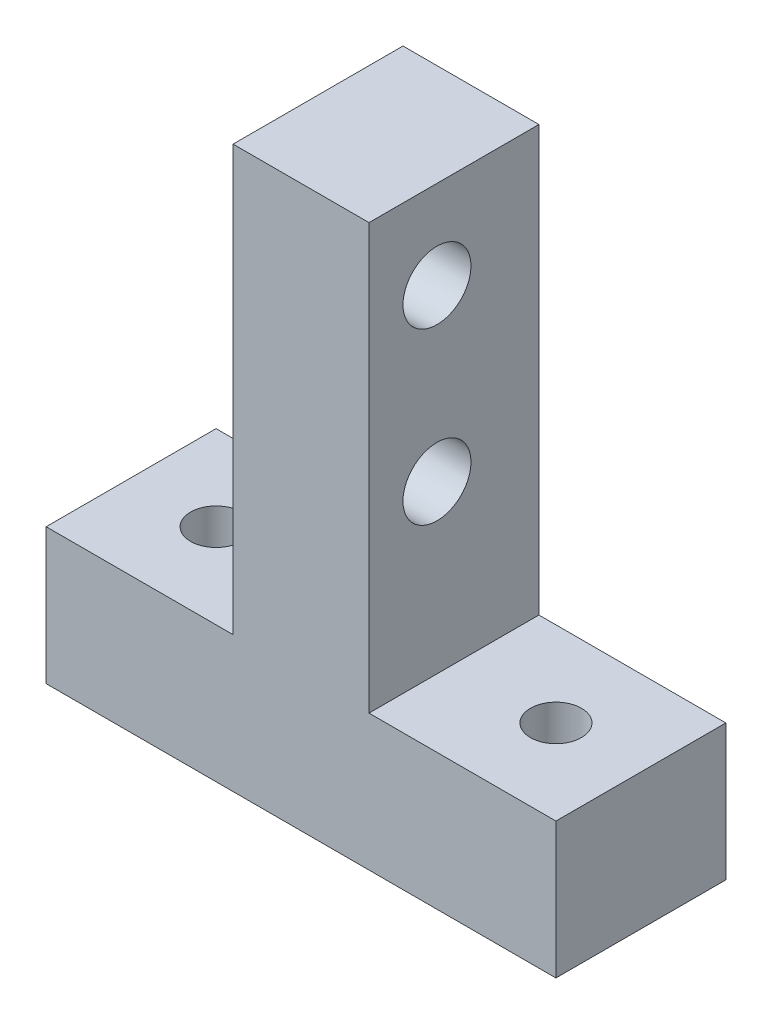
ISO-10303-21;
HEADER;
FILE_DESCRIPTION(('STEP AP214'),'2;1');
FILE_NAME('part.step','',(''),(''),'','','');
FILE_SCHEMA(('AUTOMOTIVE_DESIGN { 1 0 10303 214 1 1 1 1 }'));
ENDSEC;
DATA;
#1=APPLICATION_CONTEXT('core data for automotive mechanical design processes');
#2=APPLICATION_PROTOCOL_DEFINITION('international standard','automotive_design',2000,#1);
#3=PRODUCT_CONTEXT('',#1,'mechanical');
#4=PRODUCT('Part','Part','',(#3));
#5=PRODUCT_RELATED_PRODUCT_CATEGORY('part','',(#4));
#6=PRODUCT_DEFINITION_FORMATION('','',#4);
#7=PRODUCT_DEFINITION_CONTEXT('part definition',#1,'design');
#8=PRODUCT_DEFINITION('design','',#6,#7);
#9=PRODUCT_DEFINITION_SHAPE('','',#8);
#10=(LENGTH_UNIT() NAMED_UNIT(*) SI_UNIT(.MILLI.,.METRE.));
#11=(NAMED_UNIT(*) PLANE_ANGLE_UNIT() SI_UNIT($,.RADIAN.));
#12=(NAMED_UNIT(*) SI_UNIT($,.STERADIAN.) SOLID_ANGLE_UNIT());
#13=UNCERTAINTY_MEASURE_WITH_UNIT(LENGTH_MEASURE(1.E-05),#10,'distance_accuracy_value','');
#14=(GEOMETRIC_REPRESENTATION_CONTEXT(3) GLOBAL_UNCERTAINTY_ASSIGNED_CONTEXT((#13)) GLOBAL_UNIT_ASSIGNED_CONTEXT((#10,
#11,#12)) REPRESENTATION_CONTEXT('',''));
#15=CARTESIAN_POINT('',(0.,0.,0.));
#16=DIRECTION('',(0.,0.,1.));
#17=DIRECTION('',(1.,0.,0.));
#18=AXIS2_PLACEMENT_3D('',#15,#16,#17);
#19=CARTESIAN_POINT('',(0.,8.,0.));
#20=DIRECTION('',(0.,1.,0.));
#21=DIRECTION('',(0.,0.,1.));
#22=AXIS2_PLACEMENT_3D('',#19,#20,#21);
#23=PLANE('',#22);
#24=CARTESIAN_POINT('',(10.,8.,0.));
#25=DIRECTION('',(0.,1.,0.));
#26=DIRECTION('',(0.,0.,1.));
#27=AXIS2_PLACEMENT_3D('',#24,#25,#26);
#28=CIRCLE('',#27,1.5);
#29=CARTESIAN_POINT('',(10.,8.,1.5));
#30=VERTEX_POINT('',#29);
#31=EDGE_CURVE('E178',#30,#30,#28,.T.);
#32=ORIENTED_EDGE('',*,*,#31,.F.);
#33=EDGE_LOOP('',(#32));
#34=FACE_BOUND('',#33,.T.);
#35=DIRECTION('',(0.,0.,-1.));
#36=VECTOR('',#35,1.);
#37=CARTESIAN_POINT('',(4.,8.,-5.));
#38=LINE('',#37,#36);
#39=CARTESIAN_POINT('',(4.,8.,5.));
#40=VERTEX_POINT('',#39);
#41=CARTESIAN_POINT('',(4.,8.,-5.));
#42=VERTEX_POINT('',#41);
#43=EDGE_CURVE('E47',#40,#42,#38,.T.);
#44=ORIENTED_EDGE('',*,*,#43,.F.);
#45=DIRECTION('',(1.,0.,0.));
#46=VECTOR('',#45,1.);
#47=CARTESIAN_POINT('',(-15.,8.,5.));
#48=LINE('',#47,#46);
#49=CARTESIAN_POINT('',(15.,8.,5.));
#50=VERTEX_POINT('',#49);
#51=EDGE_CURVE('E136',#40,#50,#48,.T.);
#52=ORIENTED_EDGE('',*,*,#51,.T.);
#53=DIRECTION('',(0.,0.,-1.));
#54=VECTOR('',#53,1.);
#55=CARTESIAN_POINT('',(15.,8.,-5.));
#56=LINE('',#55,#54);
#57=CARTESIAN_POINT('',(15.,8.,-5.));
#58=VERTEX_POINT('',#57);
#59=EDGE_CURVE('E127',#50,#58,#56,.T.);
#60=ORIENTED_EDGE('',*,*,#59,.T.);
#61=DIRECTION('',(-1.,0.,0.));
#62=VECTOR('',#61,1.);
#63=CARTESIAN_POINT('',(-15.,8.,-5.));
#64=LINE('',#63,#62);
#65=EDGE_CURVE('E132',#58,#42,#64,.T.);
#66=ORIENTED_EDGE('',*,*,#65,.T.);
#67=EDGE_LOOP('',(#44,#52,#60,#66));
#68=FACE_BOUND('',#67,.T.);
#69=ADVANCED_FACE('F32',(#34,#68),#23,.T.);
#70=CARTESIAN_POINT('',(15.,8.,-5.));
#71=DIRECTION('',(-1.,0.,0.));
#72=DIRECTION('',(0.,0.,1.));
#73=AXIS2_PLACEMENT_3D('',#70,#71,#72);
#74=PLANE('',#73);
#75=DIRECTION('',(0.,0.,-1.));
#76=VECTOR('',#75,1.);
#77=CARTESIAN_POINT('',(15.,0.,-5.));
#78=LINE('',#77,#76);
#79=CARTESIAN_POINT('',(15.,0.,5.));
#80=VERTEX_POINT('',#79);
#81=CARTESIAN_POINT('',(15.,0.,-5.));
#82=VERTEX_POINT('',#81);
#83=EDGE_CURVE('E118',#80,#82,#78,.T.);
#84=ORIENTED_EDGE('',*,*,#83,.T.);
#85=DIRECTION('',(0.,-1.,0.));
#86=VECTOR('',#85,1.);
#87=CARTESIAN_POINT('',(15.,8.,-5.));
#88=LINE('',#87,#86);
#89=EDGE_CURVE('E11',#58,#82,#88,.T.);
#90=ORIENTED_EDGE('',*,*,#89,.F.);
#91=ORIENTED_EDGE('',*,*,#59,.F.);
#92=DIRECTION('',(0.,-1.,0.));
#93=VECTOR('',#92,1.);
#94=CARTESIAN_POINT('',(15.,8.,5.));
#95=LINE('',#94,#93);
#96=EDGE_CURVE('E138',#50,#80,#95,.T.);
#97=ORIENTED_EDGE('',*,*,#96,.T.);
#98=EDGE_LOOP('',(#84,#90,#91,#97));
#99=FACE_BOUND('',#98,.T.);
#100=ADVANCED_FACE('F34',(#99),#74,.F.);
#101=CARTESIAN_POINT('',(-15.,8.,-5.));
#102=DIRECTION('',(0.,0.,1.));
#103=DIRECTION('',(1.,0.,0.));
#104=AXIS2_PLACEMENT_3D('',#101,#102,#103);
#105=PLANE('',#104);
#106=DIRECTION('',(-1.,0.,0.));
#107=VECTOR('',#106,1.);
#108=CARTESIAN_POINT('',(-15.,0.,-5.));
#109=LINE('',#108,#107);
#110=CARTESIAN_POINT('',(-15.,0.,-5.));
#111=VERTEX_POINT('',#110);
#112=EDGE_CURVE('E121',#82,#111,#109,.T.);
#113=ORIENTED_EDGE('',*,*,#112,.T.);
#114=DIRECTION('',(0.,-1.,0.));
#115=VECTOR('',#114,1.);
#116=CARTESIAN_POINT('',(-15.,8.,-5.));
#117=LINE('',#116,#115);
#118=CARTESIAN_POINT('',(-15.,8.,-5.));
#119=VERTEX_POINT('',#118);
#120=EDGE_CURVE('E40',#119,#111,#117,.T.);
#121=ORIENTED_EDGE('',*,*,#120,.F.);
#122=CARTESIAN_POINT('',(-4.,8.,-5.));
#123=VERTEX_POINT('',#122);
#124=EDGE_CURVE('E130',#123,#119,#64,.T.);
#125=ORIENTED_EDGE('',*,*,#124,.F.);
#126=DIRECTION('',(0.,-1.,0.));
#127=VECTOR('',#126,1.);
#128=CARTESIAN_POINT('',(-4.,33.,-5.));
#129=LINE('',#128,#127);
#130=CARTESIAN_POINT('',(-4.,33.,-5.));
#131=VERTEX_POINT('',#130);
#132=EDGE_CURVE('E103',#131,#123,#129,.T.);
#133=ORIENTED_EDGE('',*,*,#132,.F.);
#134=DIRECTION('',(-1.,0.,0.));
#135=VECTOR('',#134,1.);
#136=CARTESIAN_POINT('',(-4.,33.,-5.));
#137=LINE('',#136,#135);
#138=CARTESIAN_POINT('',(4.,33.,-5.));
#139=VERTEX_POINT('',#138);
#140=EDGE_CURVE('E97',#139,#131,#137,.T.);
#141=ORIENTED_EDGE('',*,*,#140,.F.);
#142=DIRECTION('',(0.,-1.,0.));
#143=VECTOR('',#142,1.);
#144=CARTESIAN_POINT('',(4.,33.,-5.));
#145=LINE('',#144,#143);
#146=EDGE_CURVE('E101',#139,#42,#145,.T.);
#147=ORIENTED_EDGE('',*,*,#146,.T.);
#148=ORIENTED_EDGE('',*,*,#65,.F.);
#149=ORIENTED_EDGE('',*,*,#89,.T.);
#150=EDGE_LOOP('',(#113,#121,#125,#133,#141,#147,#148,#149));
#151=FACE_BOUND('',#150,.T.);
#152=ADVANCED_FACE('F99',(#151),#105,.F.);
#153=CARTESIAN_POINT('',(-15.,8.,-5.));
#154=DIRECTION('',(1.,0.,0.));
#155=DIRECTION('',(0.,0.,-1.));
#156=AXIS2_PLACEMENT_3D('',#153,#154,#155);
#157=PLANE('',#156);
#158=DIRECTION('',(0.,0.,1.));
#159=VECTOR('',#158,1.);
#160=CARTESIAN_POINT('',(-15.,0.,-5.));
#161=LINE('',#160,#159);
#162=CARTESIAN_POINT('',(-15.,0.,5.));
#163=VERTEX_POINT('',#162);
#164=EDGE_CURVE('E141',#111,#163,#161,.T.);
#165=ORIENTED_EDGE('',*,*,#164,.T.);
#166=DIRECTION('',(0.,-1.,0.));
#167=VECTOR('',#166,1.);
#168=CARTESIAN_POINT('',(-15.,8.,5.));
#169=LINE('',#168,#167);
#170=CARTESIAN_POINT('',(-15.,8.,5.));
#171=VERTEX_POINT('',#170);
#172=EDGE_CURVE('E146',#171,#163,#169,.T.);
#173=ORIENTED_EDGE('',*,*,#172,.F.);
#174=DIRECTION('',(0.,0.,1.));
#175=VECTOR('',#174,1.);
#176=CARTESIAN_POINT('',(-15.,8.,-5.));
#177=LINE('',#176,#175);
#178=EDGE_CURVE('E134',#119,#171,#177,.T.);
#179=ORIENTED_EDGE('',*,*,#178,.F.);
#180=ORIENTED_EDGE('',*,*,#120,.T.);
#181=EDGE_LOOP('',(#165,#173,#179,#180));
#182=FACE_BOUND('',#181,.T.);
#183=ADVANCED_FACE('F153',(#182),#157,.F.);
#184=CARTESIAN_POINT('',(-15.,8.,5.));
#185=DIRECTION('',(0.,0.,-1.));
#186=DIRECTION('',(-1.,0.,0.));
#187=AXIS2_PLACEMENT_3D('',#184,#185,#186);
#188=PLANE('',#187);
#189=DIRECTION('',(1.,0.,0.));
#190=VECTOR('',#189,1.);
#191=CARTESIAN_POINT('',(-15.,0.,5.));
#192=LINE('',#191,#190);
#193=EDGE_CURVE('E131',#163,#80,#192,.T.);
#194=ORIENTED_EDGE('',*,*,#193,.T.);
#195=ORIENTED_EDGE('',*,*,#96,.F.);
#196=ORIENTED_EDGE('',*,*,#51,.F.);
#197=DIRECTION('',(0.,-1.,0.));
#198=VECTOR('',#197,1.);
#199=CARTESIAN_POINT('',(4.,33.,5.));
#200=LINE('',#199,#198);
#201=CARTESIAN_POINT('',(4.,33.,5.));
#202=VERTEX_POINT('',#201);
#203=EDGE_CURVE('E166',#202,#40,#200,.T.);
#204=ORIENTED_EDGE('',*,*,#203,.F.);
#205=DIRECTION('',(1.,0.,0.));
#206=VECTOR('',#205,1.);
#207=CARTESIAN_POINT('',(-4.,33.,5.));
#208=LINE('',#207,#206);
#209=CARTESIAN_POINT('',(-4.,33.,5.));
#210=VERTEX_POINT('',#209);
#211=EDGE_CURVE('E112',#210,#202,#208,.T.);
#212=ORIENTED_EDGE('',*,*,#211,.F.);
#213=DIRECTION('',(0.,-1.,0.));
#214=VECTOR('',#213,1.);
#215=CARTESIAN_POINT('',(-4.,33.,5.));
#216=LINE('',#215,#214);
#217=CARTESIAN_POINT('',(-4.,8.,5.));
#218=VERTEX_POINT('',#217);
#219=EDGE_CURVE('E123',#210,#218,#216,.T.);
#220=ORIENTED_EDGE('',*,*,#219,.T.);
#221=EDGE_CURVE('E137',#171,#218,#48,.T.);
#222=ORIENTED_EDGE('',*,*,#221,.F.);
#223=ORIENTED_EDGE('',*,*,#172,.T.);
#224=EDGE_LOOP('',(#194,#195,#196,#204,#212,#220,#222,#223));
#225=FACE_BOUND('',#224,.T.);
#226=ADVANCED_FACE('F161',(#225),#188,.F.);
#227=CARTESIAN_POINT('',(-10.,8.,0.));
#228=DIRECTION('',(0.,1.,0.));
#229=DIRECTION('',(0.,0.,1.));
#230=AXIS2_PLACEMENT_3D('',#227,#228,#229);
#231=CIRCLE('',#230,1.5);
#232=CARTESIAN_POINT('',(-10.,8.,1.5));
#233=VERTEX_POINT('',#232);
#234=EDGE_CURVE('E179',#233,#233,#231,.T.);
#235=ORIENTED_EDGE('',*,*,#234,.F.);
#236=EDGE_LOOP('',(#235));
#237=FACE_BOUND('',#236,.T.);
#238=DIRECTION('',(0.,0.,1.));
#239=VECTOR('',#238,1.);
#240=CARTESIAN_POINT('',(-4.,8.,-5.));
#241=LINE('',#240,#239);
#242=EDGE_CURVE('E55',#123,#218,#241,.T.);
#243=ORIENTED_EDGE('',*,*,#242,.F.);
#244=ORIENTED_EDGE('',*,*,#124,.T.);
#245=ORIENTED_EDGE('',*,*,#178,.T.);
#246=ORIENTED_EDGE('',*,*,#221,.T.);
#247=EDGE_LOOP('',(#243,#244,#245,#246));
#248=FACE_BOUND('',#247,.T.);
#249=ADVANCED_FACE('F209',(#237,#248),#23,.T.);
#250=CARTESIAN_POINT('',(0.,0.,0.));
#251=DIRECTION('',(0.,1.,0.));
#252=DIRECTION('',(0.,0.,1.));
#253=AXIS2_PLACEMENT_3D('',#250,#251,#252);
#254=PLANE('',#253);
#255=CARTESIAN_POINT('',(10.,0.,0.));
#256=DIRECTION('',(0.,1.,0.));
#257=DIRECTION('',(0.,0.,1.));
#258=AXIS2_PLACEMENT_3D('',#255,#256,#257);
#259=CIRCLE('',#258,1.5);
#260=CARTESIAN_POINT('',(10.,0.,1.5));
#261=VERTEX_POINT('',#260);
#262=EDGE_CURVE('E172',#261,#261,#259,.F.);
#263=ORIENTED_EDGE('',*,*,#262,.F.);
#264=EDGE_LOOP('',(#263));
#265=FACE_BOUND('',#264,.T.);
#266=CARTESIAN_POINT('',(-10.,0.,0.));
#267=DIRECTION('',(0.,1.,0.));
#268=DIRECTION('',(0.,0.,1.));
#269=AXIS2_PLACEMENT_3D('',#266,#267,#268);
#270=CIRCLE('',#269,1.5);
#271=CARTESIAN_POINT('',(-10.,0.,1.5));
#272=VERTEX_POINT('',#271);
#273=EDGE_CURVE('E175',#272,#272,#270,.F.);
#274=ORIENTED_EDGE('',*,*,#273,.F.);
#275=EDGE_LOOP('',(#274));
#276=FACE_BOUND('',#275,.T.);
#277=ORIENTED_EDGE('',*,*,#83,.F.);
#278=ORIENTED_EDGE('',*,*,#193,.F.);
#279=ORIENTED_EDGE('',*,*,#164,.F.);
#280=ORIENTED_EDGE('',*,*,#112,.F.);
#281=EDGE_LOOP('',(#277,#278,#279,#280));
#282=FACE_BOUND('',#281,.T.);
#283=ADVANCED_FACE('F158',(#265,#276,#282),#254,.F.);
#284=CARTESIAN_POINT('',(4.,33.,-5.));
#285=DIRECTION('',(-1.,0.,0.));
#286=DIRECTION('',(0.,0.,1.));
#287=AXIS2_PLACEMENT_3D('',#284,#285,#286);
#288=PLANE('',#287);
#289=CARTESIAN_POINT('',(4.,27.8,1.));
#290=DIRECTION('',(-1.,0.,0.));
#291=DIRECTION('',(0.,0.,1.));
#292=AXIS2_PLACEMENT_3D('',#289,#290,#291);
#293=CIRCLE('',#292,2.);
#294=CARTESIAN_POINT('',(4.,27.8,3.));
#295=VERTEX_POINT('',#294);
#296=EDGE_CURVE('E182',#295,#295,#293,.F.);
#297=ORIENTED_EDGE('',*,*,#296,.F.);
#298=EDGE_LOOP('',(#297));
#299=FACE_BOUND('',#298,.T.);
#300=CARTESIAN_POINT('',(4.,17.8,1.));
#301=DIRECTION('',(-1.,0.,0.));
#302=DIRECTION('',(0.,0.,1.));
#303=AXIS2_PLACEMENT_3D('',#300,#301,#302);
#304=CIRCLE('',#303,2.);
#305=CARTESIAN_POINT('',(4.,17.8,3.));
#306=VERTEX_POINT('',#305);
#307=EDGE_CURVE('E187',#306,#306,#304,.F.);
#308=ORIENTED_EDGE('',*,*,#307,.F.);
#309=EDGE_LOOP('',(#308));
#310=FACE_BOUND('',#309,.T.);
#311=ORIENTED_EDGE('',*,*,#43,.T.);
#312=ORIENTED_EDGE('',*,*,#146,.F.);
#313=DIRECTION('',(0.,0.,-1.));
#314=VECTOR('',#313,1.);
#315=CARTESIAN_POINT('',(4.,33.,-5.));
#316=LINE('',#315,#314);
#317=EDGE_CURVE('E107',#202,#139,#316,.T.);
#318=ORIENTED_EDGE('',*,*,#317,.F.);
#319=ORIENTED_EDGE('',*,*,#203,.T.);
#320=EDGE_LOOP('',(#311,#312,#318,#319));
#321=FACE_BOUND('',#320,.T.);
#322=ADVANCED_FACE('F117',(#299,#310,#321),#288,.F.);
#323=CARTESIAN_POINT('',(-4.,33.,-5.));
#324=DIRECTION('',(1.,0.,0.));
#325=DIRECTION('',(0.,0.,-1.));
#326=AXIS2_PLACEMENT_3D('',#323,#324,#325);
#327=PLANE('',#326);
#328=CARTESIAN_POINT('',(-4.,27.8,1.));
#329=DIRECTION('',(-1.,0.,0.));
#330=DIRECTION('',(0.,0.,1.));
#331=AXIS2_PLACEMENT_3D('',#328,#329,#330);
#332=CIRCLE('',#331,2.);
#333=CARTESIAN_POINT('',(-4.,27.8,3.));
#334=VERTEX_POINT('',#333);
#335=EDGE_CURVE('E190',#334,#334,#332,.T.);
#336=ORIENTED_EDGE('',*,*,#335,.F.);
#337=EDGE_LOOP('',(#336));
#338=FACE_BOUND('',#337,.T.);
#339=CARTESIAN_POINT('',(-4.,17.8,1.));
#340=DIRECTION('',(-1.,0.,0.));
#341=DIRECTION('',(0.,0.,1.));
#342=AXIS2_PLACEMENT_3D('',#339,#340,#341);
#343=CIRCLE('',#342,2.);
#344=CARTESIAN_POINT('',(-4.,17.8,3.));
#345=VERTEX_POINT('',#344);
#346=EDGE_CURVE('E191',#345,#345,#343,.T.);
#347=ORIENTED_EDGE('',*,*,#346,.F.);
#348=EDGE_LOOP('',(#347));
#349=FACE_BOUND('',#348,.T.);
#350=ORIENTED_EDGE('',*,*,#242,.T.);
#351=ORIENTED_EDGE('',*,*,#219,.F.);
#352=DIRECTION('',(0.,0.,1.));
#353=VECTOR('',#352,1.);
#354=CARTESIAN_POINT('',(-4.,33.,-5.));
#355=LINE('',#354,#353);
#356=EDGE_CURVE('E106',#131,#210,#355,.T.);
#357=ORIENTED_EDGE('',*,*,#356,.F.);
#358=ORIENTED_EDGE('',*,*,#132,.T.);
#359=EDGE_LOOP('',(#350,#351,#357,#358));
#360=FACE_BOUND('',#359,.T.);
#361=ADVANCED_FACE('F202',(#338,#349,#360),#327,.F.);
#362=CARTESIAN_POINT('',(0.,33.,0.));
#363=DIRECTION('',(0.,1.,0.));
#364=DIRECTION('',(0.,0.,1.));
#365=AXIS2_PLACEMENT_3D('',#362,#363,#364);
#366=PLANE('',#365);
#367=ORIENTED_EDGE('',*,*,#317,.T.);
#368=ORIENTED_EDGE('',*,*,#140,.T.);
#369=ORIENTED_EDGE('',*,*,#356,.T.);
#370=ORIENTED_EDGE('',*,*,#211,.T.);
#371=EDGE_LOOP('',(#367,#368,#369,#370));
#372=FACE_BOUND('',#371,.T.);
#373=ADVANCED_FACE('F110',(#372),#366,.T.);
#374=CARTESIAN_POINT('',(-10.,-0.000999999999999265,0.));
#375=DIRECTION('',(0.,1.,0.));
#376=DIRECTION('',(0.,0.,1.));
#377=AXIS2_PLACEMENT_3D('',#374,#375,#376);
#378=CYLINDRICAL_SURFACE('',#377,1.5);
#379=ORIENTED_EDGE('',*,*,#234,.T.);
#380=EDGE_LOOP('',(#379));
#381=FACE_BOUND('',#380,.T.);
#382=ORIENTED_EDGE('',*,*,#273,.T.);
#383=EDGE_LOOP('',(#382));
#384=FACE_BOUND('',#383,.T.);
#385=ADVANCED_FACE('F233',(#381,#384),#378,.F.);
#386=CARTESIAN_POINT('',(10.,-0.000999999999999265,0.));
#387=DIRECTION('',(0.,1.,0.));
#388=DIRECTION('',(0.,0.,1.));
#389=AXIS2_PLACEMENT_3D('',#386,#387,#388);
#390=CYLINDRICAL_SURFACE('',#389,1.5);
#391=ORIENTED_EDGE('',*,*,#31,.T.);
#392=EDGE_LOOP('',(#391));
#393=FACE_BOUND('',#392,.T.);
#394=ORIENTED_EDGE('',*,*,#262,.T.);
#395=EDGE_LOOP('',(#394));
#396=FACE_BOUND('',#395,.T.);
#397=ADVANCED_FACE('F229',(#393,#396),#390,.F.);
#398=CARTESIAN_POINT('',(15.001,17.8,1.));
#399=DIRECTION('',(-1.,0.,0.));
#400=DIRECTION('',(0.,0.,1.));
#401=AXIS2_PLACEMENT_3D('',#398,#399,#400);
#402=CYLINDRICAL_SURFACE('',#401,2.);
#403=ORIENTED_EDGE('',*,*,#346,.T.);
#404=EDGE_LOOP('',(#403));
#405=FACE_BOUND('',#404,.T.);
#406=ORIENTED_EDGE('',*,*,#307,.T.);
#407=EDGE_LOOP('',(#406));
#408=FACE_BOUND('',#407,.T.);
#409=ADVANCED_FACE('F232',(#405,#408),#402,.F.);
#410=CARTESIAN_POINT('',(15.001,27.8,1.));
#411=DIRECTION('',(-1.,0.,0.));
#412=DIRECTION('',(0.,0.,1.));
#413=AXIS2_PLACEMENT_3D('',#410,#411,#412);
#414=CYLINDRICAL_SURFACE('',#413,2.);
#415=ORIENTED_EDGE('',*,*,#335,.T.);
#416=EDGE_LOOP('',(#415));
#417=FACE_BOUND('',#416,.T.);
#418=ORIENTED_EDGE('',*,*,#296,.T.);
#419=EDGE_LOOP('',(#418));
#420=FACE_BOUND('',#419,.T.);
#421=ADVANCED_FACE('F199',(#417,#420),#414,.F.);
#422=CLOSED_SHELL('',(#69,#100,#152,#183,#226,#249,#283,#322,#361,#373,#385,#397,#409,#421));
#423=MANIFOLD_SOLID_BREP('B2',#422);
#424=ADVANCED_BREP_SHAPE_REPRESENTATION('',(#18,#423),#14);
#425=SHAPE_DEFINITION_REPRESENTATION(#9,#424);
ENDSEC;
END-ISO-10303-21;
